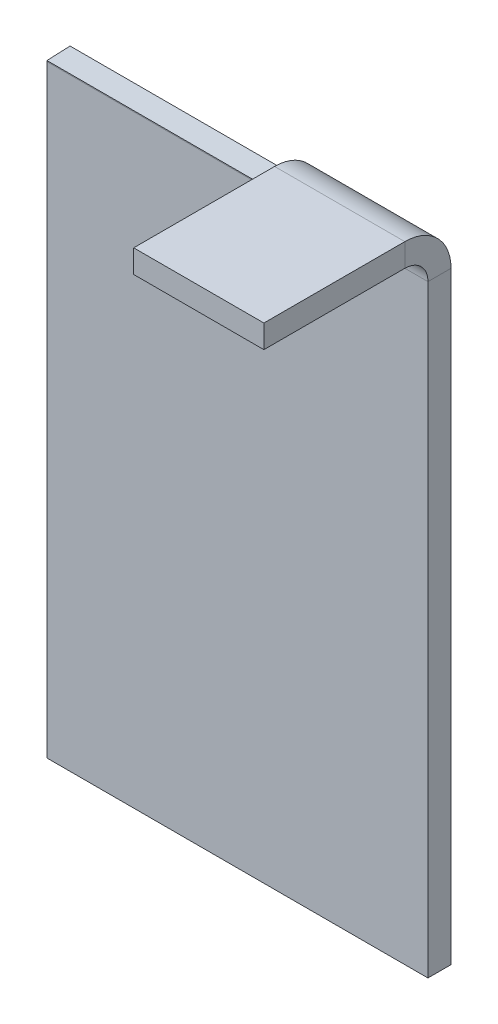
ISO-10303-21;
HEADER;
FILE_DESCRIPTION(('STEP AP214'),'2;1');
FILE_NAME('part.step','',(''),(''),'','','');
FILE_SCHEMA(('AUTOMOTIVE_DESIGN { 1 0 10303 214 1 1 1 1 }'));
ENDSEC;
DATA;
#1=APPLICATION_CONTEXT('core data for automotive mechanical design processes');
#2=APPLICATION_PROTOCOL_DEFINITION('international standard','automotive_design',2000,#1);
#3=PRODUCT_CONTEXT('',#1,'mechanical');
#4=PRODUCT('Part','Part','',(#3));
#5=PRODUCT_RELATED_PRODUCT_CATEGORY('part','',(#4));
#6=PRODUCT_DEFINITION_FORMATION('','',#4);
#7=PRODUCT_DEFINITION_CONTEXT('part definition',#1,'design');
#8=PRODUCT_DEFINITION('design','',#6,#7);
#9=PRODUCT_DEFINITION_SHAPE('','',#8);
#10=(LENGTH_UNIT() NAMED_UNIT(*) SI_UNIT(.MILLI.,.METRE.));
#11=(NAMED_UNIT(*) PLANE_ANGLE_UNIT() SI_UNIT($,.RADIAN.));
#12=(NAMED_UNIT(*) SI_UNIT($,.STERADIAN.) SOLID_ANGLE_UNIT());
#13=UNCERTAINTY_MEASURE_WITH_UNIT(LENGTH_MEASURE(1.E-05),#10,'distance_accuracy_value','');
#14=(GEOMETRIC_REPRESENTATION_CONTEXT(3) GLOBAL_UNCERTAINTY_ASSIGNED_CONTEXT((#13)) GLOBAL_UNIT_ASSIGNED_CONTEXT((#10,
#11,#12)) REPRESENTATION_CONTEXT('',''));
#15=CARTESIAN_POINT('',(0.,0.,0.));
#16=DIRECTION('',(0.,0.,1.));
#17=DIRECTION('',(1.,0.,0.));
#18=AXIS2_PLACEMENT_3D('',#15,#16,#17);
#19=CARTESIAN_POINT('',(24.7406525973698,45.0759892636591,-78.6945662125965));
#20=DIRECTION('',(0.,-1.,0.));
#21=DIRECTION('',(1.,0.,0.));
#22=AXIS2_PLACEMENT_3D('',#19,#20,#21);
#23=PLANE('',#22);
#24=DIRECTION('',(0.,0.,1.));
#25=VECTOR('',#24,1.);
#26=CARTESIAN_POINT('',(24.7406525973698,45.0759892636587,24.3073343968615));
#27=LINE('',#26,#25);
#28=CARTESIAN_POINT('',(24.7406525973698,45.0759892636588,6.00000000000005));
#29=VERTEX_POINT('',#28);
#30=CARTESIAN_POINT('',(24.7406525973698,45.0759892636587,24.3073343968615));
#31=VERTEX_POINT('',#30);
#32=EDGE_CURVE('E56',#29,#31,#27,.T.);
#33=ORIENTED_EDGE('',*,*,#32,.F.);
#34=DIRECTION('',(-1.,0.,0.));
#35=VECTOR('',#34,1.);
#36=CARTESIAN_POINT('',(24.7406525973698,45.0759892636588,6.00000000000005));
#37=LINE('',#36,#35);
#38=CARTESIAN_POINT('',(7.82612480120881,45.0759892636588,6.00000000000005));
#39=VERTEX_POINT('',#38);
#40=EDGE_CURVE('E48',#29,#39,#37,.T.);
#41=ORIENTED_EDGE('',*,*,#40,.T.);
#42=DIRECTION('',(0.,0.,-1.));
#43=VECTOR('',#42,1.);
#44=CARTESIAN_POINT('',(7.82612480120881,45.0759892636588,-0.18086256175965));
#45=LINE('',#44,#43);
#46=CARTESIAN_POINT('',(7.82612480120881,45.0759892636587,24.3073343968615));
#47=VERTEX_POINT('',#46);
#48=EDGE_CURVE('E63',#47,#39,#45,.T.);
#49=ORIENTED_EDGE('',*,*,#48,.F.);
#50=DIRECTION('',(-1.,0.,0.));
#51=VECTOR('',#50,1.);
#52=CARTESIAN_POINT('',(7.82612480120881,45.0759892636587,24.3073343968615));
#53=LINE('',#52,#51);
#54=EDGE_CURVE('E194',#31,#47,#53,.T.);
#55=ORIENTED_EDGE('',*,*,#54,.F.);
#56=EDGE_LOOP('',(#33,#41,#49,#55));
#57=FACE_BOUND('',#56,.T.);
#58=ADVANCED_FACE('F39',(#57),#23,.F.);
#59=CARTESIAN_POINT('',(7.82612480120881,42.0759892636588,-0.180862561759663));
#60=DIRECTION('',(1.,0.,0.));
#61=DIRECTION('',(0.,1.,0.));
#62=AXIS2_PLACEMENT_3D('',#59,#60,#61);
#63=PLANE('',#62);
#64=ORIENTED_EDGE('',*,*,#48,.T.);
#65=DIRECTION('',(0.,-1.,0.));
#66=VECTOR('',#65,1.);
#67=CARTESIAN_POINT('',(7.82612480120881,42.0759892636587,6.00000000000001));
#68=LINE('',#67,#66);
#69=CARTESIAN_POINT('',(7.82612480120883,42.0759892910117,6.));
#70=VERTEX_POINT('',#69);
#71=EDGE_CURVE('E204',#39,#70,#68,.T.);
#72=ORIENTED_EDGE('',*,*,#71,.T.);
#73=DIRECTION('',(0.,0.,-1.));
#74=VECTOR('',#73,1.);
#75=CARTESIAN_POINT('',(7.82612480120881,42.0759892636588,-0.180862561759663));
#76=LINE('',#75,#74);
#77=CARTESIAN_POINT('',(7.82612480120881,42.0759892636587,24.3073343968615));
#78=VERTEX_POINT('',#77);
#79=EDGE_CURVE('E193',#78,#70,#76,.T.);
#80=ORIENTED_EDGE('',*,*,#79,.F.);
#81=DIRECTION('',(0.,1.,0.));
#82=VECTOR('',#81,1.);
#83=CARTESIAN_POINT('',(7.82612480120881,42.0759892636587,24.3073343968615));
#84=LINE('',#83,#82);
#85=EDGE_CURVE('E196',#78,#47,#84,.T.);
#86=ORIENTED_EDGE('',*,*,#85,.T.);
#87=EDGE_LOOP('',(#64,#72,#80,#86));
#88=FACE_BOUND('',#87,.T.);
#89=ADVANCED_FACE('F252',(#88),#63,.F.);
#90=CARTESIAN_POINT('',(24.7406525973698,42.0759892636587,24.3073343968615));
#91=DIRECTION('',(-1.,0.,0.));
#92=DIRECTION('',(0.,-1.,0.));
#93=AXIS2_PLACEMENT_3D('',#90,#91,#92);
#94=PLANE('',#93);
#95=DIRECTION('',(0.,0.,1.));
#96=VECTOR('',#95,1.);
#97=CARTESIAN_POINT('',(24.7406525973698,42.0759892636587,24.3073343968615));
#98=LINE('',#97,#96);
#99=CARTESIAN_POINT('',(24.7406525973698,42.0759892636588,6.00000000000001));
#100=VERTEX_POINT('',#99);
#101=CARTESIAN_POINT('',(24.7406525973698,42.0759892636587,24.3073343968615));
#102=VERTEX_POINT('',#101);
#103=EDGE_CURVE('E43',#100,#102,#98,.T.);
#104=ORIENTED_EDGE('',*,*,#103,.F.);
#105=DIRECTION('',(0.,1.,0.));
#106=VECTOR('',#105,1.);
#107=CARTESIAN_POINT('',(24.7406525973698,42.0759892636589,6.00000000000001));
#108=LINE('',#107,#106);
#109=EDGE_CURVE('E12',#100,#29,#108,.T.);
#110=ORIENTED_EDGE('',*,*,#109,.T.);
#111=ORIENTED_EDGE('',*,*,#32,.T.);
#112=DIRECTION('',(0.,1.,0.));
#113=VECTOR('',#112,1.);
#114=CARTESIAN_POINT('',(24.7406525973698,42.0759892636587,24.3073343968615));
#115=LINE('',#114,#113);
#116=EDGE_CURVE('E198',#102,#31,#115,.T.);
#117=ORIENTED_EDGE('',*,*,#116,.F.);
#118=EDGE_LOOP('',(#104,#110,#111,#117));
#119=FACE_BOUND('',#118,.T.);
#120=ADVANCED_FACE('F41',(#119),#94,.F.);
#121=CARTESIAN_POINT('',(7.82612480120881,42.0759892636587,24.3073343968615));
#122=DIRECTION('',(0.,0.,-1.));
#123=DIRECTION('',(0.,1.,0.));
#124=AXIS2_PLACEMENT_3D('',#121,#122,#123);
#125=PLANE('',#124);
#126=ORIENTED_EDGE('',*,*,#54,.T.);
#127=ORIENTED_EDGE('',*,*,#85,.F.);
#128=DIRECTION('',(-1.,0.,0.));
#129=VECTOR('',#128,1.);
#130=CARTESIAN_POINT('',(7.82612480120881,42.0759892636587,24.3073343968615));
#131=LINE('',#130,#129);
#132=EDGE_CURVE('E191',#102,#78,#131,.T.);
#133=ORIENTED_EDGE('',*,*,#132,.F.);
#134=ORIENTED_EDGE('',*,*,#116,.T.);
#135=EDGE_LOOP('',(#126,#127,#133,#134));
#136=FACE_BOUND('',#135,.T.);
#137=ADVANCED_FACE('F248',(#136),#125,.F.);
#138=CARTESIAN_POINT('',(24.7406525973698,42.0759892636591,-78.6945662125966));
#139=DIRECTION('',(0.,-1.,0.));
#140=DIRECTION('',(1.,0.,0.));
#141=AXIS2_PLACEMENT_3D('',#138,#139,#140);
#142=PLANE('',#141);
#143=DIRECTION('',(-1.,0.,0.));
#144=VECTOR('',#143,1.);
#145=CARTESIAN_POINT('',(24.7406525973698,42.0759892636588,6.00000000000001));
#146=LINE('',#145,#144);
#147=EDGE_CURVE('E201',#100,#70,#146,.T.);
#148=ORIENTED_EDGE('',*,*,#147,.F.);
#149=ORIENTED_EDGE('',*,*,#103,.T.);
#150=ORIENTED_EDGE('',*,*,#132,.T.);
#151=ORIENTED_EDGE('',*,*,#79,.T.);
#152=EDGE_LOOP('',(#148,#149,#150,#151));
#153=FACE_BOUND('',#152,.T.);
#154=ADVANCED_FACE('F211',(#153),#142,.T.);
#155=CARTESIAN_POINT('',(-24.7406525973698,-39.2568518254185,3.));
#156=DIRECTION('',(0.,1.,0.));
#157=DIRECTION('',(0.,0.,1.));
#158=AXIS2_PLACEMENT_3D('',#155,#156,#157);
#159=PLANE('',#158);
#160=DIRECTION('',(1.,0.,0.));
#161=VECTOR('',#160,1.);
#162=CARTESIAN_POINT('',(-24.7406525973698,-39.2568518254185,0.));
#163=LINE('',#162,#161);
#164=CARTESIAN_POINT('',(-24.7406525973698,-39.2568518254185,0.));
#165=VERTEX_POINT('',#164);
#166=CARTESIAN_POINT('',(24.7406525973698,-39.2568518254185,0.));
#167=VERTEX_POINT('',#166);
#168=EDGE_CURVE('E148',#165,#167,#163,.T.);
#169=ORIENTED_EDGE('',*,*,#168,.T.);
#170=DIRECTION('',(0.,0.,-1.));
#171=VECTOR('',#170,1.);
#172=CARTESIAN_POINT('',(24.7406525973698,-39.2568518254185,3.));
#173=LINE('',#172,#171);
#174=CARTESIAN_POINT('',(24.7406525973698,-39.2568518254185,3.));
#175=VERTEX_POINT('',#174);
#176=EDGE_CURVE('E179',#175,#167,#173,.T.);
#177=ORIENTED_EDGE('',*,*,#176,.F.);
#178=DIRECTION('',(1.,0.,0.));
#179=VECTOR('',#178,1.);
#180=CARTESIAN_POINT('',(-24.7406525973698,-39.2568518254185,3.));
#181=LINE('',#180,#179);
#182=CARTESIAN_POINT('',(-24.7406525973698,-39.2568518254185,3.));
#183=VERTEX_POINT('',#182);
#184=EDGE_CURVE('E128',#183,#175,#181,.T.);
#185=ORIENTED_EDGE('',*,*,#184,.F.);
#186=DIRECTION('',(0.,0.,-1.));
#187=VECTOR('',#186,1.);
#188=CARTESIAN_POINT('',(-24.7406525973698,-39.2568518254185,3.));
#189=LINE('',#188,#187);
#190=EDGE_CURVE('E125',#183,#165,#189,.T.);
#191=ORIENTED_EDGE('',*,*,#190,.T.);
#192=EDGE_LOOP('',(#169,#177,#185,#191));
#193=FACE_BOUND('',#192,.T.);
#194=ADVANCED_FACE('F240',(#193),#159,.F.);
#195=CARTESIAN_POINT('',(24.7406525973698,-39.2568518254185,3.));
#196=DIRECTION('',(0.,0.,1.));
#197=DIRECTION('',(1.,0.,0.));
#198=AXIS2_PLACEMENT_3D('',#195,#196,#197);
#199=PLANE('',#198);
#200=DIRECTION('',(0.,1.,0.));
#201=VECTOR('',#200,1.);
#202=CARTESIAN_POINT('',(24.7406525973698,63.7450487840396,3.));
#203=LINE('',#202,#201);
#204=CARTESIAN_POINT('',(24.7406525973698,39.0759892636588,3.));
#205=VERTEX_POINT('',#204);
#206=EDGE_CURVE('E134',#175,#205,#203,.T.);
#207=ORIENTED_EDGE('',*,*,#206,.T.);
#208=DIRECTION('',(-1.,0.,0.));
#209=VECTOR('',#208,1.);
#210=CARTESIAN_POINT('',(24.7406525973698,39.0759892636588,3.));
#211=LINE('',#210,#209);
#212=CARTESIAN_POINT('',(-24.7406525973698,39.0759892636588,2.99999997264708));
#213=VERTEX_POINT('',#212);
#214=EDGE_CURVE('E129',#205,#213,#211,.T.);
#215=ORIENTED_EDGE('',*,*,#214,.T.);
#216=DIRECTION('',(0.,-1.,0.));
#217=VECTOR('',#216,1.);
#218=CARTESIAN_POINT('',(-24.7406525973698,39.2568518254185,3.));
#219=LINE('',#218,#217);
#220=EDGE_CURVE('E118',#213,#183,#219,.T.);
#221=ORIENTED_EDGE('',*,*,#220,.T.);
#222=ORIENTED_EDGE('',*,*,#184,.T.);
#223=EDGE_LOOP('',(#207,#215,#221,#222));
#224=FACE_BOUND('',#223,.T.);
#225=ADVANCED_FACE('F132',(#224),#199,.T.);
#226=CARTESIAN_POINT('',(-24.7406525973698,39.2568518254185,3.));
#227=DIRECTION('',(1.,0.,0.));
#228=DIRECTION('',(0.,0.,-1.));
#229=AXIS2_PLACEMENT_3D('',#226,#227,#228);
#230=PLANE('',#229);
#231=DIRECTION('',(0.,0.,1.));
#232=VECTOR('',#231,1.);
#233=CARTESIAN_POINT('',(-24.7406525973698,39.0759892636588,3.));
#234=LINE('',#233,#232);
#235=CARTESIAN_POINT('',(-24.7406525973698,39.0759892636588,0.));
#236=VERTEX_POINT('',#235);
#237=EDGE_CURVE('E122',#236,#213,#234,.T.);
#238=ORIENTED_EDGE('',*,*,#237,.F.);
#239=DIRECTION('',(0.,-1.,0.));
#240=VECTOR('',#239,1.);
#241=CARTESIAN_POINT('',(-24.7406525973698,39.2568518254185,0.));
#242=LINE('',#241,#240);
#243=EDGE_CURVE('E182',#236,#165,#242,.T.);
#244=ORIENTED_EDGE('',*,*,#243,.T.);
#245=ORIENTED_EDGE('',*,*,#190,.F.);
#246=ORIENTED_EDGE('',*,*,#220,.F.);
#247=EDGE_LOOP('',(#238,#244,#245,#246));
#248=FACE_BOUND('',#247,.T.);
#249=ADVANCED_FACE('F120',(#248),#230,.F.);
#250=CARTESIAN_POINT('',(24.7406525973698,-39.2568518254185,0.));
#251=DIRECTION('',(0.,0.,1.));
#252=DIRECTION('',(1.,0.,0.));
#253=AXIS2_PLACEMENT_3D('',#250,#251,#252);
#254=PLANE('',#253);
#255=DIRECTION('',(-1.,0.,0.));
#256=VECTOR('',#255,1.);
#257=CARTESIAN_POINT('',(24.7406525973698,39.0759892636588,0.));
#258=LINE('',#257,#256);
#259=CARTESIAN_POINT('',(24.7406525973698,39.0759892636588,0.));
#260=VERTEX_POINT('',#259);
#261=EDGE_CURVE('E149',#260,#236,#258,.T.);
#262=ORIENTED_EDGE('',*,*,#261,.F.);
#263=DIRECTION('',(0.,1.,0.));
#264=VECTOR('',#263,1.);
#265=CARTESIAN_POINT('',(24.7406525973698,63.7450487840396,0.));
#266=LINE('',#265,#264);
#267=EDGE_CURVE('E177',#167,#260,#266,.T.);
#268=ORIENTED_EDGE('',*,*,#267,.F.);
#269=ORIENTED_EDGE('',*,*,#168,.F.);
#270=ORIENTED_EDGE('',*,*,#243,.F.);
#271=EDGE_LOOP('',(#262,#268,#269,#270));
#272=FACE_BOUND('',#271,.T.);
#273=ADVANCED_FACE('F231',(#272),#254,.F.);
#274=CARTESIAN_POINT('',(24.7406525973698,63.7450487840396,3.));
#275=DIRECTION('',(-1.,0.,0.));
#276=DIRECTION('',(0.,0.,1.));
#277=AXIS2_PLACEMENT_3D('',#274,#275,#276);
#278=PLANE('',#277);
#279=DIRECTION('',(0.,0.,-1.));
#280=VECTOR('',#279,1.);
#281=CARTESIAN_POINT('',(24.7406525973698,39.0759892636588,2.99999999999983));
#282=LINE('',#281,#280);
#283=EDGE_CURVE('E175',#205,#260,#282,.T.);
#284=ORIENTED_EDGE('',*,*,#283,.F.);
#285=ORIENTED_EDGE('',*,*,#206,.F.);
#286=ORIENTED_EDGE('',*,*,#176,.T.);
#287=ORIENTED_EDGE('',*,*,#267,.T.);
#288=EDGE_LOOP('',(#284,#285,#286,#287));
#289=FACE_BOUND('',#288,.T.);
#290=ADVANCED_FACE('F237',(#289),#278,.F.);
#291=CARTESIAN_POINT('',(24.7406525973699,39.0759892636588,6.00000002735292));
#292=DIRECTION('',(-1.,0.,0.));
#293=DIRECTION('',(0.,0.,1.));
#294=AXIS2_PLACEMENT_3D('',#291,#292,#293);
#295=PLANE('',#294);
#296=ORIENTED_EDGE('',*,*,#283,.T.);
#297=CARTESIAN_POINT('',(24.7406525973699,39.0759892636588,6.));
#298=DIRECTION('',(-1.,0.,0.));
#299=DIRECTION('',(0.,0.,1.));
#300=AXIS2_PLACEMENT_3D('',#297,#298,#299);
#301=CIRCLE('',#300,6.00000002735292);
#302=EDGE_CURVE('E170',#260,#29,#301,.F.);
#303=ORIENTED_EDGE('',*,*,#302,.T.);
#304=ORIENTED_EDGE('',*,*,#109,.F.);
#305=CARTESIAN_POINT('',(24.7406525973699,39.0759892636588,6.00000002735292));
#306=DIRECTION('',(1.,0.,0.));
#307=DIRECTION('',(0.,0.,-1.));
#308=AXIS2_PLACEMENT_3D('',#305,#306,#307);
#309=CIRCLE('',#308,3.00000004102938);
#310=EDGE_CURVE('E174',#205,#100,#309,.T.);
#311=ORIENTED_EDGE('',*,*,#310,.F.);
#312=EDGE_LOOP('',(#296,#303,#304,#311));
#313=FACE_BOUND('',#312,.T.);
#314=ADVANCED_FACE('F234',(#313),#295,.F.);
#315=CARTESIAN_POINT('',(7.82612480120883,39.0759892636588,6.00000002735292));
#316=DIRECTION('',(1.,0.,0.));
#317=DIRECTION('',(0.,0.,-1.));
#318=AXIS2_PLACEMENT_3D('',#315,#316,#317);
#319=PLANE('',#318);
#320=ORIENTED_EDGE('',*,*,#71,.F.);
#321=CARTESIAN_POINT('',(7.82612480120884,39.0759892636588,6.));
#322=DIRECTION('',(-1.,0.,0.));
#323=DIRECTION('',(0.,0.,1.));
#324=AXIS2_PLACEMENT_3D('',#321,#322,#323);
#325=CIRCLE('',#324,6.00000002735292);
#326=CARTESIAN_POINT('',(7.82612480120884,39.3438447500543,0.00598183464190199));
#327=VERTEX_POINT('',#326);
#328=EDGE_CURVE('E167',#39,#327,#325,.T.);
#329=ORIENTED_EDGE('',*,*,#328,.T.);
#330=DIRECTION('',(0.,-0.0446425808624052,0.999003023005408));
#331=VECTOR('',#330,1.);
#332=CARTESIAN_POINT('',(7.82612480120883,39.2099170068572,3.00299091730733));
#333=LINE('',#332,#331);
#334=CARTESIAN_POINT('',(7.82612480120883,39.2099170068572,3.00299091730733));
#335=VERTEX_POINT('',#334);
#336=EDGE_CURVE('E158',#327,#335,#333,.T.);
#337=ORIENTED_EDGE('',*,*,#336,.T.);
#338=CARTESIAN_POINT('',(7.82612480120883,39.0759892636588,6.00000002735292));
#339=DIRECTION('',(-1.,0.,0.));
#340=DIRECTION('',(0.,0.,1.));
#341=AXIS2_PLACEMENT_3D('',#338,#339,#340);
#342=CIRCLE('',#341,3.00000004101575);
#343=EDGE_CURVE('E160',#70,#335,#342,.T.);
#344=ORIENTED_EDGE('',*,*,#343,.F.);
#345=EDGE_LOOP('',(#320,#329,#337,#344));
#346=FACE_BOUND('',#345,.T.);
#347=ADVANCED_FACE('F218',(#346),#319,.F.);
#348=CARTESIAN_POINT('',(-8.45726389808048,39.2099170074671,3.00299090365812));
#349=DIRECTION('',(0.,-0.999003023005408,-0.0446425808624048));
#350=DIRECTION('',(-1.,0.,0.));
#351=AXIS2_PLACEMENT_3D('',#348,#349,#350);
#352=PLANE('',#351);
#353=ORIENTED_EDGE('',*,*,#336,.F.);
#354=DIRECTION('',(-1.,0.,0.));
#355=VECTOR('',#354,1.);
#356=CARTESIAN_POINT('',(-8.4572638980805,39.3438447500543,0.00598183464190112));
#357=LINE('',#356,#355);
#358=CARTESIAN_POINT('',(-24.7406525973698,39.3438447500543,0.00598183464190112));
#359=VERTEX_POINT('',#358);
#360=EDGE_CURVE('E164',#327,#359,#357,.T.);
#361=ORIENTED_EDGE('',*,*,#360,.T.);
#362=DIRECTION('',(0.,-0.0446425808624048,0.999003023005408));
#363=VECTOR('',#362,1.);
#364=CARTESIAN_POINT('',(-24.7406525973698,39.2099170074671,3.00299090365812));
#365=LINE('',#364,#363);
#366=CARTESIAN_POINT('',(-24.7406525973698,39.2099170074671,3.00299090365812));
#367=VERTEX_POINT('',#366);
#368=EDGE_CURVE('E156',#359,#367,#365,.T.);
#369=ORIENTED_EDGE('',*,*,#368,.T.);
#370=DIRECTION('',(-1.,0.,0.));
#371=VECTOR('',#370,1.);
#372=CARTESIAN_POINT('',(7.82612480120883,39.2099170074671,3.00299090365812));
#373=LINE('',#372,#371);
#374=EDGE_CURVE('E155',#335,#367,#373,.T.);
#375=ORIENTED_EDGE('',*,*,#374,.F.);
#376=EDGE_LOOP('',(#353,#361,#369,#375));
#377=FACE_BOUND('',#376,.T.);
#378=ADVANCED_FACE('F223',(#377),#352,.F.);
#379=CARTESIAN_POINT('',(-24.7406525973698,39.0759892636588,6.00000002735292));
#380=DIRECTION('',(1.,0.,0.));
#381=DIRECTION('',(0.,0.,-1.));
#382=AXIS2_PLACEMENT_3D('',#379,#380,#381);
#383=PLANE('',#382);
#384=CARTESIAN_POINT('',(-24.7406525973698,39.0759892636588,6.));
#385=DIRECTION('',(-1.,0.,0.));
#386=DIRECTION('',(0.,0.,1.));
#387=AXIS2_PLACEMENT_3D('',#384,#385,#386);
#388=CIRCLE('',#387,6.00000002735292);
#389=EDGE_CURVE('E147',#359,#236,#388,.T.);
#390=ORIENTED_EDGE('',*,*,#389,.T.);
#391=ORIENTED_EDGE('',*,*,#237,.T.);
#392=CARTESIAN_POINT('',(-24.7406525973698,39.0759892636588,6.00000002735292));
#393=DIRECTION('',(-1.,0.,0.));
#394=DIRECTION('',(0.,0.,1.));
#395=AXIS2_PLACEMENT_3D('',#392,#393,#394);
#396=CIRCLE('',#395,3.00000005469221);
#397=EDGE_CURVE('E145',#367,#213,#396,.T.);
#398=ORIENTED_EDGE('',*,*,#397,.F.);
#399=ORIENTED_EDGE('',*,*,#368,.F.);
#400=EDGE_LOOP('',(#390,#391,#398,#399));
#401=FACE_BOUND('',#400,.T.);
#402=ADVANCED_FACE('F144',(#401),#383,.F.);
#403=CARTESIAN_POINT('',(49.9787065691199,39.0759892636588,6.));
#404=DIRECTION('',(-1.,0.,0.));
#405=DIRECTION('',(0.,0.,1.));
#406=AXIS2_PLACEMENT_3D('',#403,#404,#405);
#407=CYLINDRICAL_SURFACE('',#406,3.00000002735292);
#408=ORIENTED_EDGE('',*,*,#374,.T.);
#409=ORIENTED_EDGE('',*,*,#397,.T.);
#410=ORIENTED_EDGE('',*,*,#214,.F.);
#411=ORIENTED_EDGE('',*,*,#310,.T.);
#412=ORIENTED_EDGE('',*,*,#147,.T.);
#413=ORIENTED_EDGE('',*,*,#343,.T.);
#414=EDGE_LOOP('',(#408,#409,#410,#411,#412,#413));
#415=FACE_BOUND('',#414,.T.);
#416=ADVANCED_FACE('F152',(#415),#407,.F.);
#417=CARTESIAN_POINT('',(49.9787065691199,39.0759892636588,6.));
#418=DIRECTION('',(-1.,0.,0.));
#419=DIRECTION('',(0.,0.,1.));
#420=AXIS2_PLACEMENT_3D('',#417,#418,#419);
#421=CYLINDRICAL_SURFACE('',#420,6.00000002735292);
#422=ORIENTED_EDGE('',*,*,#360,.F.);
#423=ORIENTED_EDGE('',*,*,#328,.F.);
#424=ORIENTED_EDGE('',*,*,#40,.F.);
#425=ORIENTED_EDGE('',*,*,#302,.F.);
#426=ORIENTED_EDGE('',*,*,#261,.T.);
#427=ORIENTED_EDGE('',*,*,#389,.F.);
#428=EDGE_LOOP('',(#422,#423,#424,#425,#426,#427));
#429=FACE_BOUND('',#428,.T.);
#430=ADVANCED_FACE('F225',(#429),#421,.T.);
#431=CLOSED_SHELL('',(#58,#89,#120,#137,#154,#194,#225,#249,#273,#290,#314,#347,#378,#402,#416,#430));
#432=MANIFOLD_SOLID_BREP('B2',#431);
#433=ADVANCED_BREP_SHAPE_REPRESENTATION('',(#18,#432),#14);
#434=SHAPE_DEFINITION_REPRESENTATION(#9,#433);
ENDSEC;
END-ISO-10303-21;
